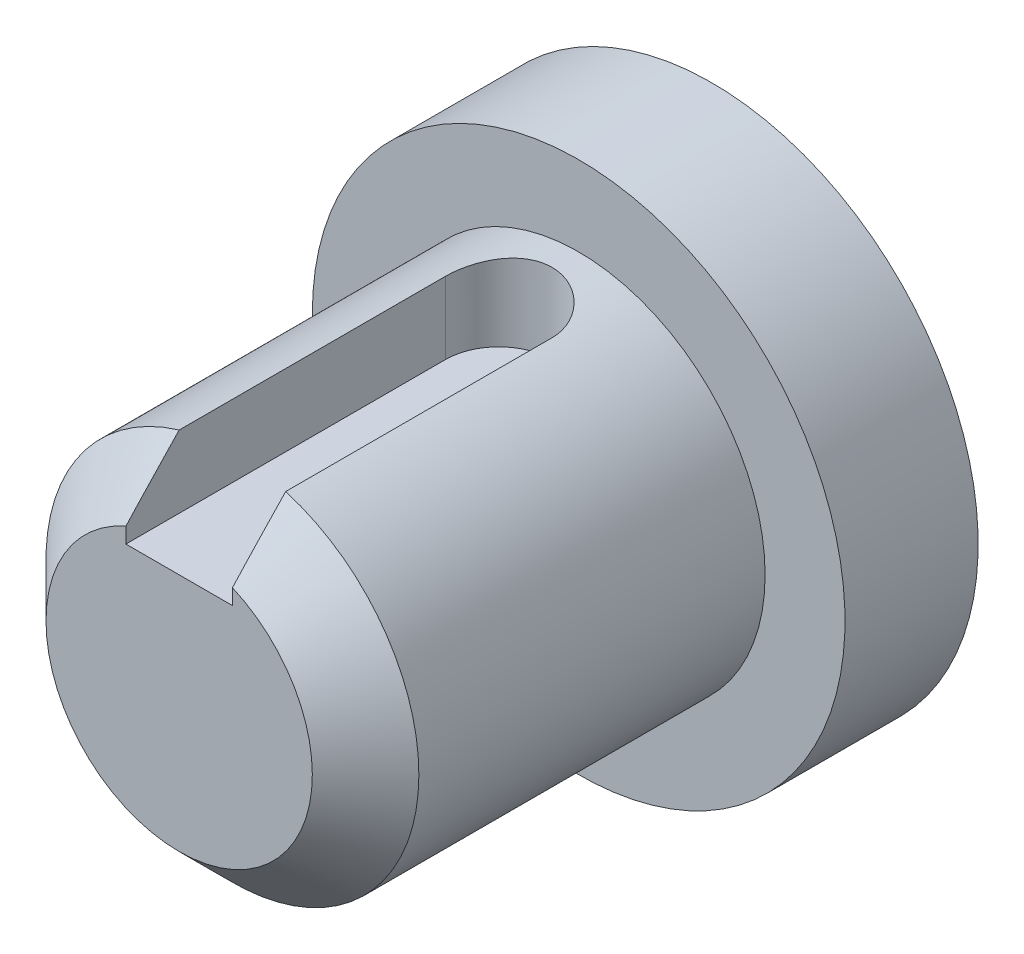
ISO-10303-21;
HEADER;
FILE_DESCRIPTION(('STEP AP214'),'2;1');
FILE_NAME('part.step','',(''),(''),'','','');
FILE_SCHEMA(('AUTOMOTIVE_DESIGN { 1 0 10303 214 1 1 1 1 }'));
ENDSEC;
DATA;
#1=APPLICATION_CONTEXT('core data for automotive mechanical design processes');
#2=APPLICATION_PROTOCOL_DEFINITION('international standard','automotive_design',2000,#1);
#3=PRODUCT_CONTEXT('',#1,'mechanical');
#4=PRODUCT('Part','Part','',(#3));
#5=PRODUCT_RELATED_PRODUCT_CATEGORY('part','',(#4));
#6=PRODUCT_DEFINITION_FORMATION('','',#4);
#7=PRODUCT_DEFINITION_CONTEXT('part definition',#1,'design');
#8=PRODUCT_DEFINITION('design','',#6,#7);
#9=PRODUCT_DEFINITION_SHAPE('','',#8);
#10=(LENGTH_UNIT() NAMED_UNIT(*) SI_UNIT(.MILLI.,.METRE.));
#11=(NAMED_UNIT(*) PLANE_ANGLE_UNIT() SI_UNIT($,.RADIAN.));
#12=(NAMED_UNIT(*) SI_UNIT($,.STERADIAN.) SOLID_ANGLE_UNIT());
#13=UNCERTAINTY_MEASURE_WITH_UNIT(LENGTH_MEASURE(1.E-05),#10,'distance_accuracy_value','');
#14=(GEOMETRIC_REPRESENTATION_CONTEXT(3) GLOBAL_UNCERTAINTY_ASSIGNED_CONTEXT((#13)) GLOBAL_UNIT_ASSIGNED_CONTEXT((#10,
#11,#12)) REPRESENTATION_CONTEXT('',''));
#15=CARTESIAN_POINT('',(0.,0.,0.));
#16=DIRECTION('',(0.,0.,1.));
#17=DIRECTION('',(1.,0.,0.));
#18=AXIS2_PLACEMENT_3D('',#15,#16,#17);
#19=CARTESIAN_POINT('',(0.,4.,11.5306225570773));
#20=DIRECTION('',(0.,1.,0.));
#21=DIRECTION('',(0.,0.,1.));
#22=AXIS2_PLACEMENT_3D('',#19,#20,#21);
#23=PLANE('',#22);
#24=CARTESIAN_POINT('',(0.,4.,3.));
#25=DIRECTION('',(0.,-1.,0.));
#26=DIRECTION('',(0.,0.,-1.));
#27=AXIS2_PLACEMENT_3D('',#24,#25,#26);
#28=CIRCLE('',#27,2.);
#29=CARTESIAN_POINT('',(2.,4.,3.));
#30=VERTEX_POINT('',#29);
#31=CARTESIAN_POINT('',(-2.,4.,3.));
#32=VERTEX_POINT('',#31);
#33=EDGE_CURVE('E84',#30,#32,#28,.F.);
#34=ORIENTED_EDGE('',*,*,#33,.T.);
#35=DIRECTION('',(0.,0.,1.));
#36=VECTOR('',#35,1.);
#37=CARTESIAN_POINT('',(-2.,4.,3.));
#38=LINE('',#37,#36);
#39=CARTESIAN_POINT('',(-2.,4.,15.));
#40=VERTEX_POINT('',#39);
#41=EDGE_CURVE('E83',#32,#40,#38,.T.);
#42=ORIENTED_EDGE('',*,*,#41,.T.);
#43=DIRECTION('',(-1.,0.,0.));
#44=VECTOR('',#43,1.);
#45=CARTESIAN_POINT('',(0.,4.,15.));
#46=LINE('',#45,#44);
#47=CARTESIAN_POINT('',(2.,4.,15.));
#48=VERTEX_POINT('',#47);
#49=EDGE_CURVE('E108',#40,#48,#46,.F.);
#50=ORIENTED_EDGE('',*,*,#49,.T.);
#51=DIRECTION('',(0.,0.,-1.));
#52=VECTOR('',#51,1.);
#53=CARTESIAN_POINT('',(2.,4.,21.2864708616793));
#54=LINE('',#53,#52);
#55=EDGE_CURVE('E94',#48,#30,#54,.T.);
#56=ORIENTED_EDGE('',*,*,#55,.T.);
#57=EDGE_LOOP('',(#34,#42,#50,#56));
#58=FACE_BOUND('',#57,.T.);
#59=ADVANCED_FACE('F16',(#58),#23,.T.);
#60=CARTESIAN_POINT('',(0.,0.,15.));
#61=DIRECTION('',(0.,0.,-1.));
#62=DIRECTION('',(-1.,0.,0.));
#63=AXIS2_PLACEMENT_3D('',#60,#61,#62);
#64=PLANE('',#63);
#65=ORIENTED_EDGE('',*,*,#49,.F.);
#66=DIRECTION('',(0.,1.,0.));
#67=VECTOR('',#66,1.);
#68=CARTESIAN_POINT('',(-2.,7.,15.));
#69=LINE('',#68,#67);
#70=CARTESIAN_POINT('',(-2.,4.58257569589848,15.0000000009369));
#71=VERTEX_POINT('',#70);
#72=EDGE_CURVE('E87',#40,#71,#69,.T.);
#73=ORIENTED_EDGE('',*,*,#72,.T.);
#74=CARTESIAN_POINT('',(0.,0.,15.0000000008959));
#75=DIRECTION('',(0.,0.,-1.));
#76=DIRECTION('',(-1.,0.,0.));
#77=AXIS2_PLACEMENT_3D('',#74,#75,#76);
#78=CIRCLE('',#77,5.00000000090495);
#79=CARTESIAN_POINT('',(2.,4.58257569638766,15.0000000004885));
#80=VERTEX_POINT('',#79);
#81=EDGE_CURVE('E77',#80,#71,#78,.T.);
#82=ORIENTED_EDGE('',*,*,#81,.F.);
#83=DIRECTION('',(0.,1.,0.));
#84=VECTOR('',#83,1.);
#85=CARTESIAN_POINT('',(2.,7.,15.));
#86=LINE('',#85,#84);
#87=EDGE_CURVE('E86',#80,#48,#86,.F.);
#88=ORIENTED_EDGE('',*,*,#87,.T.);
#89=EDGE_LOOP('',(#65,#73,#82,#88));
#90=FACE_BOUND('',#89,.T.);
#91=ADVANCED_FACE('F162',(#90),#64,.F.);
#92=CARTESIAN_POINT('',(-2.,7.,3.));
#93=DIRECTION('',(-1.,0.,0.));
#94=DIRECTION('',(0.,0.,1.));
#95=AXIS2_PLACEMENT_3D('',#92,#93,#94);
#96=PLANE('',#95);
#97=CARTESIAN_POINT('',(-1.99999999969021,4.58257569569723,15.0000000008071));
#98=CARTESIAN_POINT('',(-1.99999999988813,4.76186431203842,14.8356334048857));
#99=CARTESIAN_POINT('',(-1.99999999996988,4.94042885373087,14.6704822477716));
#100=CARTESIAN_POINT('',(-2.00000000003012,5.29639983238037,14.3389462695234));
#101=CARTESIAN_POINT('',(-2.00000000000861,5.47380630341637,14.1725614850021));
#102=CARTESIAN_POINT('',(-1.9999999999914,5.82775935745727,13.8388862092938));
#103=CARTESIAN_POINT('',(-1.9999999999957,6.00430595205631,13.6715957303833));
#104=CARTESIAN_POINT('',(-2.0000000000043,6.35672115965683,13.3362916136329));
#105=CARTESIAN_POINT('',(-2.00000000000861,6.53258975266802,13.1682779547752));
#106=CARTESIAN_POINT('',(-2.,6.70820393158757,12.9999999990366));
#107=B_SPLINE_CURVE_WITH_KNOTS('',3,(#97,#98,#99,#100,#101,#102,#103,#104,#105,#106),
.UNSPECIFIED.,.F.,.F.,(4,2,2,2,4),(0.,0.729682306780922,1.45934304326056,2.18899391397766,
2.91866613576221),.UNSPECIFIED.);
#108=CARTESIAN_POINT('',(-2.,6.70820393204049,12.9999999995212));
#109=VERTEX_POINT('',#108);
#110=EDGE_CURVE('E20',#71,#109,#107,.T.);
#111=ORIENTED_EDGE('',*,*,#110,.F.);
#112=ORIENTED_EDGE('',*,*,#72,.F.);
#113=ORIENTED_EDGE('',*,*,#41,.F.);
#114=DIRECTION('',(0.,-1.,0.));
#115=VECTOR('',#114,1.);
#116=CARTESIAN_POINT('',(-2.,7.,3.));
#117=LINE('',#116,#115);
#118=CARTESIAN_POINT('',(-2.,6.70820393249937,3.));
#119=VERTEX_POINT('',#118);
#120=EDGE_CURVE('E67',#32,#119,#117,.F.);
#121=ORIENTED_EDGE('',*,*,#120,.T.);
#122=DIRECTION('',(0.,0.,1.));
#123=VECTOR('',#122,1.);
#124=CARTESIAN_POINT('',(-2.,6.70820393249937,0.));
#125=LINE('',#124,#123);
#126=EDGE_CURVE('E70',#109,#119,#125,.F.);
#127=ORIENTED_EDGE('',*,*,#126,.F.);
#128=EDGE_LOOP('',(#111,#112,#113,#121,#127));
#129=FACE_BOUND('',#128,.T.);
#130=ADVANCED_FACE('F80',(#129),#96,.F.);
#131=CARTESIAN_POINT('',(0.,7.,3.));
#132=DIRECTION('',(0.,-1.,0.));
#133=DIRECTION('',(0.,0.,-1.));
#134=AXIS2_PLACEMENT_3D('',#131,#132,#133);
#135=CYLINDRICAL_SURFACE('',#134,2.);
#136=ORIENTED_EDGE('',*,*,#33,.F.);
#137=DIRECTION('',(0.,1.,0.));
#138=VECTOR('',#137,1.);
#139=CARTESIAN_POINT('',(2.,7.,3.));
#140=LINE('',#139,#138);
#141=CARTESIAN_POINT('',(2.,6.70820393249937,3.));
#142=VERTEX_POINT('',#141);
#143=EDGE_CURVE('E69',#30,#142,#140,.T.);
#144=ORIENTED_EDGE('',*,*,#143,.T.);
#145=CARTESIAN_POINT('',(-2.,6.70820393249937,3.));
#146=CARTESIAN_POINT('',(-2.00000099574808,6.7081995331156,2.94496595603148));
#147=CARTESIAN_POINT('',(-1.99772698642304,6.70888204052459,2.88995949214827));
#148=CARTESIAN_POINT('',(-1.98866402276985,6.71157572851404,2.78036381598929));
#149=CARTESIAN_POINT('',(-1.98187600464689,6.71358663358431,2.72577451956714));
#150=CARTESIAN_POINT('',(-1.9548506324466,6.72152749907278,2.56349252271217));
#151=CARTESIAN_POINT('',(-1.92795142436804,6.72936619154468,2.45692437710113));
#152=CARTESIAN_POINT('',(-1.85729706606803,6.74920546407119,2.25005827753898));
#153=CARTESIAN_POINT('',(-1.81354621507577,6.76120498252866,2.14975873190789));
#154=CARTESIAN_POINT('',(-1.71049896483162,6.78800553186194,1.95786034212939));
#155=CARTESIAN_POINT('',(-1.65119676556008,6.80280760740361,1.8662647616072));
#156=CARTESIAN_POINT('',(-1.51693301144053,6.83401592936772,1.69181761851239));
#157=CARTESIAN_POINT('',(-1.44160788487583,6.8504536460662,1.6092515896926));
#158=CARTESIAN_POINT('',(-1.27819153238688,6.88281585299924,1.45771395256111));
#159=CARTESIAN_POINT('',(-1.19009578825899,6.89874015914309,1.38874717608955));
#160=CARTESIAN_POINT('',(-1.00160024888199,6.92864106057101,1.26513970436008));
#161=CARTESIAN_POINT('',(-0.900998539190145,6.94257491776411,1.21079598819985));
#162=CARTESIAN_POINT('',(-0.691686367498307,6.96653558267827,1.11995955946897));
#163=CARTESIAN_POINT('',(-0.582985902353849,6.97656711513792,1.08344524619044));
#164=CARTESIAN_POINT('',(-0.394805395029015,6.98928636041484,1.0377482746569));
#165=CARTESIAN_POINT('',(-0.316579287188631,6.99328251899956,1.02361890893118));
#166=CARTESIAN_POINT('',(-0.158912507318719,6.99864042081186,1.00474319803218));
#167=CARTESIAN_POINT('',(-0.0794718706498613,7.00000224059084,0.999996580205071));
#168=CARTESIAN_POINT('',(0.109902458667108,6.99999690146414,1.00000472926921));
#169=CARTESIAN_POINT('',(0.21986465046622,6.99738511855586,1.00909362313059));
#170=CARTESIAN_POINT('',(0.436640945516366,6.98721356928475,1.04514910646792));
#171=CARTESIAN_POINT('',(0.543452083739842,6.97964928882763,1.07213200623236));
#172=CARTESIAN_POINT('',(0.750707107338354,6.96040637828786,1.14300973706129));
#173=CARTESIAN_POINT('',(0.85116099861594,6.94873441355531,1.18687718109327));
#174=CARTESIAN_POINT('',(1.04327701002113,6.92249857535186,1.29018304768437));
#175=CARTESIAN_POINT('',(1.13493895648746,6.90793464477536,1.34962177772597));
#176=CARTESIAN_POINT('',(1.30929206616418,6.87704774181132,1.48403311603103));
#177=CARTESIAN_POINT('',(1.39171940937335,6.86069128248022,1.55934023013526));
#178=CARTESIAN_POINT('',(1.54296803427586,6.82826812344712,1.7226440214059));
#179=CARTESIAN_POINT('',(1.61178658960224,6.81220148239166,1.81064323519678));
#180=CARTESIAN_POINT('',(1.73521711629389,6.78182545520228,1.99902086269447));
#181=CARTESIAN_POINT('',(1.78951077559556,6.76755858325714,2.0996151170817));
#182=CARTESIAN_POINT('',(1.88027667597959,6.74290625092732,2.30895153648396));
#183=CARTESIAN_POINT('',(1.9167639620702,6.73251751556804,2.41768673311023));
#184=CARTESIAN_POINT('',(1.96236876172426,6.71933727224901,2.60580854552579));
#185=CARTESIAN_POINT('',(1.97645330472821,6.715191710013,2.68393120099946));
#186=CARTESIAN_POINT('',(1.99527750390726,6.70961199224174,2.84135376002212));
#187=CARTESIAN_POINT('',(2.00002112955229,6.70817668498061,2.92065314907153));
#188=CARTESIAN_POINT('',(2.,6.70820393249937,3.));
#189=B_SPLINE_CURVE_WITH_KNOTS('',3,(#145,#146,#147,#148,#149,#150,#151,#152,#153,#154,#155,
#156,#157,#158,#159,#160,#161,#162,#163,#164,#165,#166,#167,#168,#169,#170,#171,#172,#173,#174,
#175,#176,#177,#178,#179,#180,#181,#182,#183,#184,#185,#186,#187,#188),.UNSPECIFIED.,.F.,.F.,(4,
2,2,2,2,2,2,2,2,2,2,2,2,2,2,2,2,2,2,2,2,4),(0.,0.164996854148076,0.329959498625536,
0.658815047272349,0.987586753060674,1.31648125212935,1.65383602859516,1.99131045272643,
2.33519463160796,2.67866114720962,2.91686961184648,3.15507115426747,3.48448249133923,
3.81419449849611,4.14337394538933,4.47255989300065,4.8095407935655,5.1465891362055,
5.49051045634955,5.83414068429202,6.07204003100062,6.30983825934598),.UNSPECIFIED.);
#190=EDGE_CURVE('E64',#119,#142,#189,.T.);
#191=ORIENTED_EDGE('',*,*,#190,.F.);
#192=ORIENTED_EDGE('',*,*,#120,.F.);
#193=EDGE_LOOP('',(#136,#144,#191,#192));
#194=FACE_BOUND('',#193,.T.);
#195=ADVANCED_FACE('F65',(#194),#135,.F.);
#196=CARTESIAN_POINT('',(2.,7.,21.2864708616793));
#197=DIRECTION('',(1.,0.,0.));
#198=DIRECTION('',(0.,0.,-1.));
#199=AXIS2_PLACEMENT_3D('',#196,#197,#198);
#200=PLANE('',#199);
#201=ORIENTED_EDGE('',*,*,#143,.F.);
#202=ORIENTED_EDGE('',*,*,#55,.F.);
#203=ORIENTED_EDGE('',*,*,#87,.F.);
#204=CARTESIAN_POINT('',(2.00000000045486,6.70820393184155,12.9999999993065));
#205=CARTESIAN_POINT('',(2.00000000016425,6.53258975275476,13.1682779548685));
#206=CARTESIAN_POINT('',(2.00000000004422,6.35672115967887,13.3362916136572));
#207=CARTESIAN_POINT('',(1.99999999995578,6.00430595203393,13.6715957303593));
#208=CARTESIAN_POINT('',(1.99999999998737,5.82775935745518,13.8388862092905));
#209=CARTESIAN_POINT('',(2.00000000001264,5.47380630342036,14.1725614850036));
#210=CARTESIAN_POINT('',(2.00000000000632,5.29639983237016,14.3389462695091));
#211=CARTESIAN_POINT('',(1.99999999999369,4.94042885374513,14.6704822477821));
#212=CARTESIAN_POINT('',(1.99999999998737,4.76186431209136,14.8356334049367));
#213=CARTESIAN_POINT('',(2.,4.5825756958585,15.0000000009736));
#214=B_SPLINE_CURVE_WITH_KNOTS('',3,(#204,#205,#206,#207,#208,#209,#210,#211,#212,#213),
.UNSPECIFIED.,.F.,.F.,(4,2,2,2,4),(0.,0.729672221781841,1.45932309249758,2.1889838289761,
2.91866613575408),.UNSPECIFIED.);
#215=CARTESIAN_POINT('',(2.,6.70820393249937,12.9999999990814));
#216=VERTEX_POINT('',#215);
#217=EDGE_CURVE('E103',#216,#80,#214,.T.);
#218=ORIENTED_EDGE('',*,*,#217,.F.);
#219=DIRECTION('',(0.,0.,1.));
#220=VECTOR('',#219,1.);
#221=CARTESIAN_POINT('',(2.,6.70820393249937,0.));
#222=LINE('',#221,#220);
#223=EDGE_CURVE('E40',#142,#216,#222,.T.);
#224=ORIENTED_EDGE('',*,*,#223,.F.);
#225=EDGE_LOOP('',(#201,#202,#203,#218,#224));
#226=FACE_BOUND('',#225,.T.);
#227=ADVANCED_FACE('F153',(#226),#200,.F.);
#228=CARTESIAN_POINT('',(0.,0.,12.9999999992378));
#229=DIRECTION('',(0.,0.,-1.));
#230=DIRECTION('',(-1.,0.,0.));
#231=AXIS2_PLACEMENT_3D('',#228,#229,#230);
#232=CONICAL_SURFACE('',#231,6.99999999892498,0.785398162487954);
#233=ORIENTED_EDGE('',*,*,#217,.T.);
#234=ORIENTED_EDGE('',*,*,#81,.T.);
#235=ORIENTED_EDGE('',*,*,#110,.T.);
#236=CARTESIAN_POINT('',(0.,0.,13.));
#237=DIRECTION('',(0.,0.,1.));
#238=DIRECTION('',(1.,0.,0.));
#239=AXIS2_PLACEMENT_3D('',#236,#237,#238);
#240=CIRCLE('',#239,7.);
#241=EDGE_CURVE('E58',#216,#109,#240,.F.);
#242=ORIENTED_EDGE('',*,*,#241,.F.);
#243=EDGE_LOOP('',(#233,#234,#235,#242));
#244=FACE_BOUND('',#243,.T.);
#245=ADVANCED_FACE('F132',(#244),#232,.T.);
#246=CARTESIAN_POINT('',(0.,0.,0.));
#247=DIRECTION('',(0.,0.,1.));
#248=DIRECTION('',(1.,0.,0.));
#249=AXIS2_PLACEMENT_3D('',#246,#247,#248);
#250=CYLINDRICAL_SURFACE('',#249,7.);
#251=ORIENTED_EDGE('',*,*,#241,.T.);
#252=ORIENTED_EDGE('',*,*,#126,.T.);
#253=ORIENTED_EDGE('',*,*,#190,.T.);
#254=ORIENTED_EDGE('',*,*,#223,.T.);
#255=EDGE_LOOP('',(#251,#252,#253,#254));
#256=FACE_BOUND('',#255,.T.);
#257=CARTESIAN_POINT('',(0.,0.,0.));
#258=DIRECTION('',(0.,0.,1.));
#259=DIRECTION('',(1.,0.,0.));
#260=AXIS2_PLACEMENT_3D('',#257,#258,#259);
#261=CIRCLE('',#260,7.);
#262=CARTESIAN_POINT('',(7.,0.,0.));
#263=VERTEX_POINT('',#262);
#264=EDGE_CURVE('E99',#263,#263,#261,.F.);
#265=ORIENTED_EDGE('',*,*,#264,.F.);
#266=EDGE_LOOP('',(#265));
#267=FACE_BOUND('',#266,.T.);
#268=ADVANCED_FACE('F73',(#256,#267),#250,.T.);
#269=CARTESIAN_POINT('',(0.,0.,0.));
#270=DIRECTION('',(0.,0.,1.));
#271=DIRECTION('',(1.,0.,0.));
#272=AXIS2_PLACEMENT_3D('',#269,#270,#271);
#273=PLANE('',#272);
#274=ORIENTED_EDGE('',*,*,#264,.T.);
#275=EDGE_LOOP('',(#274));
#276=FACE_BOUND('',#275,.T.);
#277=CARTESIAN_POINT('',(0.,0.,0.));
#278=DIRECTION('',(0.,0.,-1.));
#279=DIRECTION('',(-1.,0.,0.));
#280=AXIS2_PLACEMENT_3D('',#277,#278,#279);
#281=CIRCLE('',#280,10.);
#282=CARTESIAN_POINT('',(-10.,0.,0.));
#283=VERTEX_POINT('',#282);
#284=EDGE_CURVE('E31',#283,#283,#281,.T.);
#285=ORIENTED_EDGE('',*,*,#284,.F.);
#286=EDGE_LOOP('',(#285));
#287=FACE_BOUND('',#286,.T.);
#288=ADVANCED_FACE('F131',(#276,#287),#273,.T.);
#289=CARTESIAN_POINT('',(0.,0.,0.));
#290=DIRECTION('',(0.,0.,-1.));
#291=DIRECTION('',(-1.,0.,0.));
#292=AXIS2_PLACEMENT_3D('',#289,#290,#291);
#293=CYLINDRICAL_SURFACE('',#292,10.);
#294=ORIENTED_EDGE('',*,*,#284,.T.);
#295=EDGE_LOOP('',(#294));
#296=FACE_BOUND('',#295,.T.);
#297=CARTESIAN_POINT('',(0.,0.,-5.));
#298=DIRECTION('',(0.,0.,-1.));
#299=DIRECTION('',(-1.,0.,0.));
#300=AXIS2_PLACEMENT_3D('',#297,#298,#299);
#301=CIRCLE('',#300,10.);
#302=CARTESIAN_POINT('',(-10.,0.,-5.));
#303=VERTEX_POINT('',#302);
#304=EDGE_CURVE('E10',#303,#303,#301,.F.);
#305=ORIENTED_EDGE('',*,*,#304,.T.);
#306=EDGE_LOOP('',(#305));
#307=FACE_BOUND('',#306,.T.);
#308=ADVANCED_FACE('F135',(#296,#307),#293,.T.);
#309=CARTESIAN_POINT('',(0.,0.,-5.));
#310=DIRECTION('',(0.,0.,1.));
#311=DIRECTION('',(1.,0.,0.));
#312=AXIS2_PLACEMENT_3D('',#309,#310,#311);
#313=PLANE('',#312);
#314=ORIENTED_EDGE('',*,*,#304,.F.);
#315=EDGE_LOOP('',(#314));
#316=FACE_BOUND('',#315,.T.);
#317=ADVANCED_FACE('F18',(#316),#313,.F.);
#318=CLOSED_SHELL('',(#59,#91,#130,#195,#227,#245,#268,#288,#308,#317));
#319=MANIFOLD_SOLID_BREP('B1',#318);
#320=ADVANCED_BREP_SHAPE_REPRESENTATION('',(#18,#319),#14);
#321=SHAPE_DEFINITION_REPRESENTATION(#9,#320);
ENDSEC;
END-ISO-10303-21;
